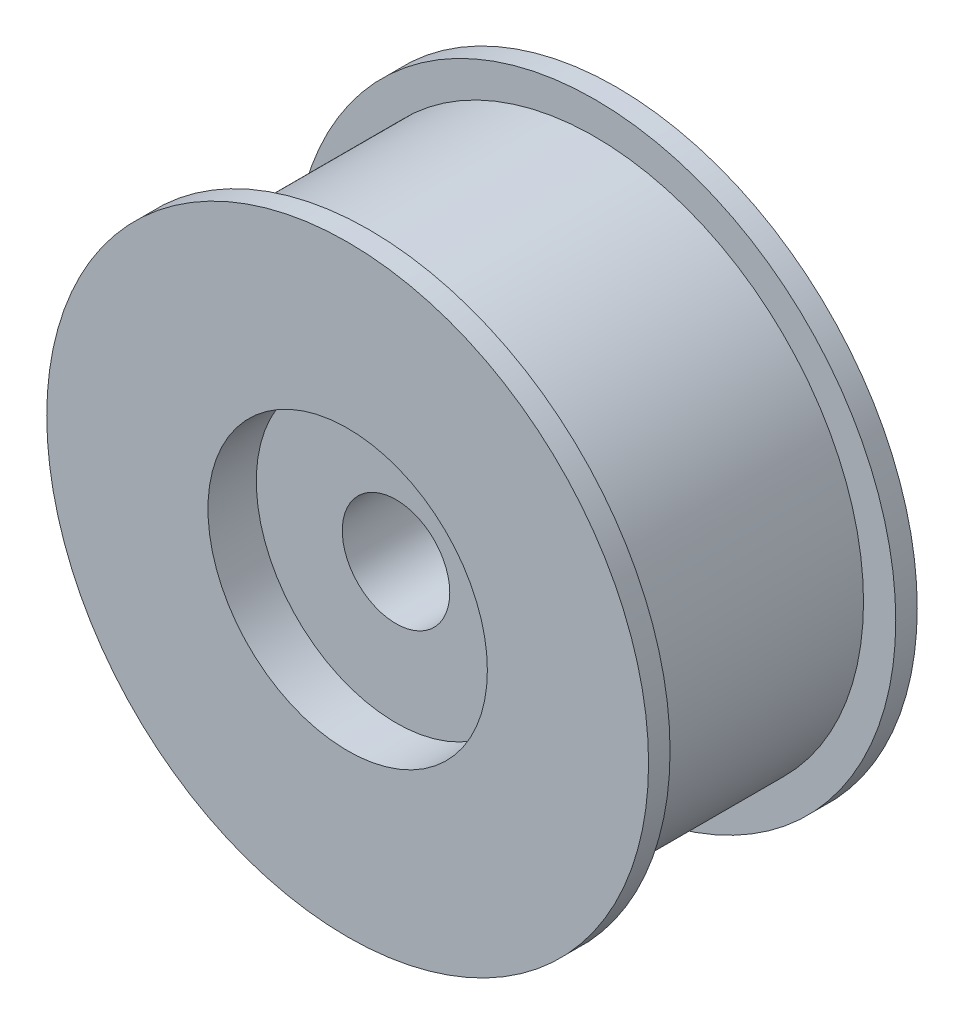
ISO-10303-21;
HEADER;
FILE_DESCRIPTION(('STEP AP214'),'2;1');
FILE_NAME('part.step','',(''),(''),'','','');
FILE_SCHEMA(('AUTOMOTIVE_DESIGN { 1 0 10303 214 1 1 1 1 }'));
ENDSEC;
DATA;
#1=APPLICATION_CONTEXT('core data for automotive mechanical design processes');
#2=APPLICATION_PROTOCOL_DEFINITION('international standard','automotive_design',2000,#1);
#3=PRODUCT_CONTEXT('',#1,'mechanical');
#4=PRODUCT('Part','Part','',(#3));
#5=PRODUCT_RELATED_PRODUCT_CATEGORY('part','',(#4));
#6=PRODUCT_DEFINITION_FORMATION('','',#4);
#7=PRODUCT_DEFINITION_CONTEXT('part definition',#1,'design');
#8=PRODUCT_DEFINITION('design','',#6,#7);
#9=PRODUCT_DEFINITION_SHAPE('','',#8);
#10=(LENGTH_UNIT() NAMED_UNIT(*) SI_UNIT(.MILLI.,.METRE.));
#11=(NAMED_UNIT(*) PLANE_ANGLE_UNIT() SI_UNIT($,.RADIAN.));
#12=(NAMED_UNIT(*) SI_UNIT($,.STERADIAN.) SOLID_ANGLE_UNIT());
#13=UNCERTAINTY_MEASURE_WITH_UNIT(LENGTH_MEASURE(1.E-05),#10,'distance_accuracy_value','');
#14=(GEOMETRIC_REPRESENTATION_CONTEXT(3) GLOBAL_UNCERTAINTY_ASSIGNED_CONTEXT((#13)) GLOBAL_UNIT_ASSIGNED_CONTEXT((#10,
#11,#12)) REPRESENTATION_CONTEXT('',''));
#15=CARTESIAN_POINT('',(0.,0.,0.));
#16=DIRECTION('',(0.,0.,1.));
#17=DIRECTION('',(1.,0.,0.));
#18=AXIS2_PLACEMENT_3D('',#15,#16,#17);
#19=CARTESIAN_POINT('',(0.,0.,17.8646380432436));
#20=DIRECTION('',(0.,0.,1.));
#21=DIRECTION('',(1.,0.,0.));
#22=AXIS2_PLACEMENT_3D('',#19,#20,#21);
#23=CYLINDRICAL_SURFACE('',#22,11.);
#24=CARTESIAN_POINT('',(0.,0.,-12.5));
#25=DIRECTION('',(0.,0.,1.));
#26=DIRECTION('',(1.,0.,0.));
#27=AXIS2_PLACEMENT_3D('',#24,#25,#26);
#28=CIRCLE('',#27,11.);
#29=CARTESIAN_POINT('',(11.,0.,-12.5));
#30=VERTEX_POINT('',#29);
#31=EDGE_CURVE('E8',#30,#30,#28,.T.);
#32=ORIENTED_EDGE('',*,*,#31,.F.);
#33=EDGE_LOOP('',(#32));
#34=FACE_BOUND('',#33,.T.);
#35=CARTESIAN_POINT('',(0.,0.,-8.));
#36=DIRECTION('',(0.,0.,1.));
#37=DIRECTION('',(1.,0.,0.));
#38=AXIS2_PLACEMENT_3D('',#35,#36,#37);
#39=CIRCLE('',#38,11.);
#40=CARTESIAN_POINT('',(11.,0.,-8.));
#41=VERTEX_POINT('',#40);
#42=EDGE_CURVE('E52',#41,#41,#39,.T.);
#43=ORIENTED_EDGE('',*,*,#42,.T.);
#44=EDGE_LOOP('',(#43));
#45=FACE_BOUND('',#44,.T.);
#46=ADVANCED_FACE('F12',(#34,#45),#23,.F.);
#47=CARTESIAN_POINT('',(0.,11.,-12.5));
#48=DIRECTION('',(0.,0.,1.));
#49=DIRECTION('',(1.,0.,0.));
#50=AXIS2_PLACEMENT_3D('',#47,#48,#49);
#51=PLANE('',#50);
#52=CARTESIAN_POINT('',(0.,0.,-12.5));
#53=DIRECTION('',(0.,0.,1.));
#54=DIRECTION('',(1.,0.,0.));
#55=AXIS2_PLACEMENT_3D('',#52,#53,#54);
#56=CIRCLE('',#55,28.);
#57=CARTESIAN_POINT('',(28.,0.,-12.5));
#58=VERTEX_POINT('',#57);
#59=EDGE_CURVE('E18',#58,#58,#56,.T.);
#60=ORIENTED_EDGE('',*,*,#59,.F.);
#61=EDGE_LOOP('',(#60));
#62=FACE_BOUND('',#61,.T.);
#63=ORIENTED_EDGE('',*,*,#31,.T.);
#64=EDGE_LOOP('',(#63));
#65=FACE_BOUND('',#64,.T.);
#66=ADVANCED_FACE('F113',(#62,#65),#51,.F.);
#67=CARTESIAN_POINT('',(0.,0.,17.8646380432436));
#68=DIRECTION('',(0.,0.,1.));
#69=DIRECTION('',(1.,0.,0.));
#70=AXIS2_PLACEMENT_3D('',#67,#68,#69);
#71=CYLINDRICAL_SURFACE('',#70,28.);
#72=CARTESIAN_POINT('',(0.,0.,-10.5));
#73=DIRECTION('',(0.,0.,1.));
#74=DIRECTION('',(1.,0.,0.));
#75=AXIS2_PLACEMENT_3D('',#72,#73,#74);
#76=CIRCLE('',#75,28.);
#77=CARTESIAN_POINT('',(28.,0.,-10.5));
#78=VERTEX_POINT('',#77);
#79=EDGE_CURVE('E22',#78,#78,#76,.T.);
#80=ORIENTED_EDGE('',*,*,#79,.F.);
#81=EDGE_LOOP('',(#80));
#82=FACE_BOUND('',#81,.T.);
#83=ORIENTED_EDGE('',*,*,#59,.T.);
#84=EDGE_LOOP('',(#83));
#85=FACE_BOUND('',#84,.T.);
#86=ADVANCED_FACE('F108',(#82,#85),#71,.T.);
#87=CARTESIAN_POINT('',(0.,28.,-10.5));
#88=DIRECTION('',(0.,0.,-1.));
#89=DIRECTION('',(-1.,0.,0.));
#90=AXIS2_PLACEMENT_3D('',#87,#88,#89);
#91=PLANE('',#90);
#92=CARTESIAN_POINT('',(0.,0.,-10.5));
#93=DIRECTION('',(0.,0.,1.));
#94=DIRECTION('',(1.,0.,0.));
#95=AXIS2_PLACEMENT_3D('',#92,#93,#94);
#96=CIRCLE('',#95,25.);
#97=CARTESIAN_POINT('',(25.,0.,-10.5));
#98=VERTEX_POINT('',#97);
#99=EDGE_CURVE('E26',#98,#98,#96,.T.);
#100=ORIENTED_EDGE('',*,*,#99,.F.);
#101=EDGE_LOOP('',(#100));
#102=FACE_BOUND('',#101,.T.);
#103=ORIENTED_EDGE('',*,*,#79,.T.);
#104=EDGE_LOOP('',(#103));
#105=FACE_BOUND('',#104,.T.);
#106=ADVANCED_FACE('F102',(#102,#105),#91,.F.);
#107=CARTESIAN_POINT('',(0.,0.,17.8646380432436));
#108=DIRECTION('',(0.,0.,1.));
#109=DIRECTION('',(1.,0.,0.));
#110=AXIS2_PLACEMENT_3D('',#107,#108,#109);
#111=CYLINDRICAL_SURFACE('',#110,25.);
#112=CARTESIAN_POINT('',(0.,0.,10.5));
#113=DIRECTION('',(0.,0.,1.));
#114=DIRECTION('',(1.,0.,0.));
#115=AXIS2_PLACEMENT_3D('',#112,#113,#114);
#116=CIRCLE('',#115,25.);
#117=CARTESIAN_POINT('',(25.,0.,10.5));
#118=VERTEX_POINT('',#117);
#119=EDGE_CURVE('E31',#118,#118,#116,.T.);
#120=ORIENTED_EDGE('',*,*,#119,.F.);
#121=EDGE_LOOP('',(#120));
#122=FACE_BOUND('',#121,.T.);
#123=ORIENTED_EDGE('',*,*,#99,.T.);
#124=EDGE_LOOP('',(#123));
#125=FACE_BOUND('',#124,.T.);
#126=ADVANCED_FACE('F96',(#122,#125),#111,.T.);
#127=CARTESIAN_POINT('',(0.,25.,10.5));
#128=DIRECTION('',(0.,0.,1.));
#129=DIRECTION('',(1.,0.,0.));
#130=AXIS2_PLACEMENT_3D('',#127,#128,#129);
#131=PLANE('',#130);
#132=CARTESIAN_POINT('',(0.,0.,10.5));
#133=DIRECTION('',(0.,0.,1.));
#134=DIRECTION('',(1.,0.,0.));
#135=AXIS2_PLACEMENT_3D('',#132,#133,#134);
#136=CIRCLE('',#135,28.);
#137=CARTESIAN_POINT('',(28.,0.,10.5));
#138=VERTEX_POINT('',#137);
#139=EDGE_CURVE('E34',#138,#138,#136,.T.);
#140=ORIENTED_EDGE('',*,*,#139,.F.);
#141=EDGE_LOOP('',(#140));
#142=FACE_BOUND('',#141,.T.);
#143=ORIENTED_EDGE('',*,*,#119,.T.);
#144=EDGE_LOOP('',(#143));
#145=FACE_BOUND('',#144,.T.);
#146=ADVANCED_FACE('F90',(#142,#145),#131,.F.);
#147=CARTESIAN_POINT('',(0.,0.,17.8646380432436));
#148=DIRECTION('',(0.,0.,1.));
#149=DIRECTION('',(1.,0.,0.));
#150=AXIS2_PLACEMENT_3D('',#147,#148,#149);
#151=CYLINDRICAL_SURFACE('',#150,28.);
#152=CARTESIAN_POINT('',(0.,0.,12.5));
#153=DIRECTION('',(0.,0.,1.));
#154=DIRECTION('',(1.,0.,0.));
#155=AXIS2_PLACEMENT_3D('',#152,#153,#154);
#156=CIRCLE('',#155,28.);
#157=CARTESIAN_POINT('',(28.,0.,12.5));
#158=VERTEX_POINT('',#157);
#159=EDGE_CURVE('E37',#158,#158,#156,.T.);
#160=ORIENTED_EDGE('',*,*,#159,.F.);
#161=EDGE_LOOP('',(#160));
#162=FACE_BOUND('',#161,.T.);
#163=ORIENTED_EDGE('',*,*,#139,.T.);
#164=EDGE_LOOP('',(#163));
#165=FACE_BOUND('',#164,.T.);
#166=ADVANCED_FACE('F84',(#162,#165),#151,.T.);
#167=CARTESIAN_POINT('',(0.,28.,12.5));
#168=DIRECTION('',(0.,0.,-1.));
#169=DIRECTION('',(-1.,0.,0.));
#170=AXIS2_PLACEMENT_3D('',#167,#168,#169);
#171=PLANE('',#170);
#172=CARTESIAN_POINT('',(0.,0.,12.5));
#173=DIRECTION('',(0.,0.,1.));
#174=DIRECTION('',(1.,0.,0.));
#175=AXIS2_PLACEMENT_3D('',#172,#173,#174);
#176=CIRCLE('',#175,13.);
#177=CARTESIAN_POINT('',(13.,0.,12.5));
#178=VERTEX_POINT('',#177);
#179=EDGE_CURVE('E40',#178,#178,#176,.T.);
#180=ORIENTED_EDGE('',*,*,#179,.F.);
#181=EDGE_LOOP('',(#180));
#182=FACE_BOUND('',#181,.T.);
#183=ORIENTED_EDGE('',*,*,#159,.T.);
#184=EDGE_LOOP('',(#183));
#185=FACE_BOUND('',#184,.T.);
#186=ADVANCED_FACE('F78',(#182,#185),#171,.F.);
#187=CARTESIAN_POINT('',(0.,0.,17.8646380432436));
#188=DIRECTION('',(0.,0.,1.));
#189=DIRECTION('',(1.,0.,0.));
#190=AXIS2_PLACEMENT_3D('',#187,#188,#189);
#191=CYLINDRICAL_SURFACE('',#190,13.);
#192=CARTESIAN_POINT('',(0.,0.,8.));
#193=DIRECTION('',(0.,0.,1.));
#194=DIRECTION('',(1.,0.,0.));
#195=AXIS2_PLACEMENT_3D('',#192,#193,#194);
#196=CIRCLE('',#195,13.);
#197=CARTESIAN_POINT('',(13.,0.,8.));
#198=VERTEX_POINT('',#197);
#199=EDGE_CURVE('E43',#198,#198,#196,.T.);
#200=ORIENTED_EDGE('',*,*,#199,.F.);
#201=EDGE_LOOP('',(#200));
#202=FACE_BOUND('',#201,.T.);
#203=ORIENTED_EDGE('',*,*,#179,.T.);
#204=EDGE_LOOP('',(#203));
#205=FACE_BOUND('',#204,.T.);
#206=ADVANCED_FACE('F72',(#202,#205),#191,.F.);
#207=CARTESIAN_POINT('',(0.,13.,8.));
#208=DIRECTION('',(0.,0.,-1.));
#209=DIRECTION('',(-1.,0.,0.));
#210=AXIS2_PLACEMENT_3D('',#207,#208,#209);
#211=PLANE('',#210);
#212=CARTESIAN_POINT('',(0.,0.,8.));
#213=DIRECTION('',(0.,0.,1.));
#214=DIRECTION('',(1.,0.,0.));
#215=AXIS2_PLACEMENT_3D('',#212,#213,#214);
#216=CIRCLE('',#215,5.);
#217=CARTESIAN_POINT('',(5.,0.,8.));
#218=VERTEX_POINT('',#217);
#219=EDGE_CURVE('E46',#218,#218,#216,.T.);
#220=ORIENTED_EDGE('',*,*,#219,.F.);
#221=EDGE_LOOP('',(#220));
#222=FACE_BOUND('',#221,.T.);
#223=ORIENTED_EDGE('',*,*,#199,.T.);
#224=EDGE_LOOP('',(#223));
#225=FACE_BOUND('',#224,.T.);
#226=ADVANCED_FACE('F66',(#222,#225),#211,.F.);
#227=CARTESIAN_POINT('',(0.,0.,17.8646380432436));
#228=DIRECTION('',(0.,0.,1.));
#229=DIRECTION('',(1.,0.,0.));
#230=AXIS2_PLACEMENT_3D('',#227,#228,#229);
#231=CYLINDRICAL_SURFACE('',#230,5.);
#232=CARTESIAN_POINT('',(0.,0.,-8.));
#233=DIRECTION('',(0.,0.,1.));
#234=DIRECTION('',(1.,0.,0.));
#235=AXIS2_PLACEMENT_3D('',#232,#233,#234);
#236=CIRCLE('',#235,5.);
#237=CARTESIAN_POINT('',(5.,0.,-8.));
#238=VERTEX_POINT('',#237);
#239=EDGE_CURVE('E49',#238,#238,#236,.T.);
#240=ORIENTED_EDGE('',*,*,#239,.F.);
#241=EDGE_LOOP('',(#240));
#242=FACE_BOUND('',#241,.T.);
#243=ORIENTED_EDGE('',*,*,#219,.T.);
#244=EDGE_LOOP('',(#243));
#245=FACE_BOUND('',#244,.T.);
#246=ADVANCED_FACE('F60',(#242,#245),#231,.F.);
#247=CARTESIAN_POINT('',(0.,5.,-8.));
#248=DIRECTION('',(0.,0.,1.));
#249=DIRECTION('',(1.,0.,0.));
#250=AXIS2_PLACEMENT_3D('',#247,#248,#249);
#251=PLANE('',#250);
#252=ORIENTED_EDGE('',*,*,#42,.F.);
#253=EDGE_LOOP('',(#252));
#254=FACE_BOUND('',#253,.T.);
#255=ORIENTED_EDGE('',*,*,#239,.T.);
#256=EDGE_LOOP('',(#255));
#257=FACE_BOUND('',#256,.T.);
#258=ADVANCED_FACE('F57',(#254,#257),#251,.F.);
#259=CLOSED_SHELL('',(#46,#66,#86,#106,#126,#146,#166,#186,#206,#226,#246,#258));
#260=MANIFOLD_SOLID_BREP('B1',#259);
#261=ADVANCED_BREP_SHAPE_REPRESENTATION('',(#18,#260),#14);
#262=SHAPE_DEFINITION_REPRESENTATION(#9,#261);
ENDSEC;
END-ISO-10303-21;
